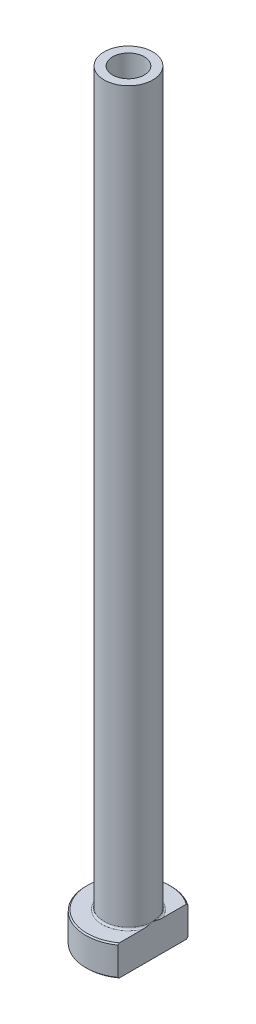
ISO-10303-21;
HEADER;
FILE_DESCRIPTION(('STEP AP214'),'2;1');
FILE_NAME('part.step','',(''),(''),'','','');
FILE_SCHEMA(('AUTOMOTIVE_DESIGN { 1 0 10303 214 1 1 1 1 }'));
ENDSEC;
DATA;
#1=APPLICATION_CONTEXT('core data for automotive mechanical design processes');
#2=APPLICATION_PROTOCOL_DEFINITION('international standard','automotive_design',2000,#1);
#3=PRODUCT_CONTEXT('',#1,'mechanical');
#4=PRODUCT('Part','Part','',(#3));
#5=PRODUCT_RELATED_PRODUCT_CATEGORY('part','',(#4));
#6=PRODUCT_DEFINITION_FORMATION('','',#4);
#7=PRODUCT_DEFINITION_CONTEXT('part definition',#1,'design');
#8=PRODUCT_DEFINITION('design','',#6,#7);
#9=PRODUCT_DEFINITION_SHAPE('','',#8);
#10=(LENGTH_UNIT() NAMED_UNIT(*) SI_UNIT(.MILLI.,.METRE.));
#11=(NAMED_UNIT(*) PLANE_ANGLE_UNIT() SI_UNIT($,.RADIAN.));
#12=(NAMED_UNIT(*) SI_UNIT($,.STERADIAN.) SOLID_ANGLE_UNIT());
#13=UNCERTAINTY_MEASURE_WITH_UNIT(LENGTH_MEASURE(1.E-05),#10,'distance_accuracy_value','');
#14=(GEOMETRIC_REPRESENTATION_CONTEXT(3) GLOBAL_UNCERTAINTY_ASSIGNED_CONTEXT((#13)) GLOBAL_UNIT_ASSIGNED_CONTEXT((#10,
#11,#12)) REPRESENTATION_CONTEXT('',''));
#15=CARTESIAN_POINT('',(0.,0.,0.));
#16=DIRECTION('',(0.,0.,1.));
#17=DIRECTION('',(1.,0.,0.));
#18=AXIS2_PLACEMENT_3D('',#15,#16,#17);
#19=CARTESIAN_POINT('',(0.,92.1876809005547,0.));
#20=DIRECTION('',(0.,1.,0.));
#21=DIRECTION('',(0.,0.,1.));
#22=AXIS2_PLACEMENT_3D('',#19,#20,#21);
#23=CYLINDRICAL_SURFACE('',#22,2.59999999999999);
#24=CARTESIAN_POINT('',(0.,125.,0.));
#25=DIRECTION('',(0.,1.,0.));
#26=DIRECTION('',(0.,0.,1.));
#27=AXIS2_PLACEMENT_3D('',#24,#25,#26);
#28=CIRCLE('',#27,2.6);
#29=CARTESIAN_POINT('',(0.,125.,2.6));
#30=VERTEX_POINT('',#29);
#31=EDGE_CURVE('E167',#30,#30,#28,.T.);
#32=ORIENTED_EDGE('',*,*,#31,.T.);
#33=EDGE_LOOP('',(#32));
#34=FACE_BOUND('',#33,.T.);
#35=CARTESIAN_POINT('',(0.,80.,0.));
#36=DIRECTION('',(0.,1.,0.));
#37=DIRECTION('',(0.,0.,1.));
#38=AXIS2_PLACEMENT_3D('',#35,#36,#37);
#39=CIRCLE('',#38,2.59999999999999);
#40=CARTESIAN_POINT('',(0.,80.,2.59999999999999));
#41=VERTEX_POINT('',#40);
#42=EDGE_CURVE('E170',#41,#41,#39,.T.);
#43=ORIENTED_EDGE('',*,*,#42,.F.);
#44=EDGE_LOOP('',(#43));
#45=FACE_BOUND('',#44,.T.);
#46=ADVANCED_FACE('F32',(#34,#45),#23,.F.);
#47=CARTESIAN_POINT('',(-2.6,125.,0.));
#48=DIRECTION('',(0.,1.,0.));
#49=DIRECTION('',(0.,0.,1.));
#50=AXIS2_PLACEMENT_3D('',#47,#48,#49);
#51=PLANE('',#50);
#52=CARTESIAN_POINT('',(0.,125.,0.));
#53=DIRECTION('',(0.,1.,0.));
#54=DIRECTION('',(0.,0.,1.));
#55=AXIS2_PLACEMENT_3D('',#52,#53,#54);
#56=CIRCLE('',#55,4.);
#57=CARTESIAN_POINT('',(0.,125.,4.));
#58=VERTEX_POINT('',#57);
#59=EDGE_CURVE('E174',#58,#58,#56,.T.);
#60=ORIENTED_EDGE('',*,*,#59,.T.);
#61=EDGE_LOOP('',(#60));
#62=FACE_BOUND('',#61,.T.);
#63=ORIENTED_EDGE('',*,*,#31,.F.);
#64=EDGE_LOOP('',(#63));
#65=FACE_BOUND('',#64,.T.);
#66=ADVANCED_FACE('F157',(#62,#65),#51,.T.);
#67=CARTESIAN_POINT('',(0.,92.1876809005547,0.));
#68=DIRECTION('',(0.,1.,0.));
#69=DIRECTION('',(0.,0.,1.));
#70=AXIS2_PLACEMENT_3D('',#67,#68,#69);
#71=CYLINDRICAL_SURFACE('',#70,4.);
#72=CARTESIAN_POINT('',(0.,5.3,0.));
#73=DIRECTION('',(0.,1.,0.));
#74=DIRECTION('',(0.,0.,1.));
#75=AXIS2_PLACEMENT_3D('',#72,#73,#74);
#76=CIRCLE('',#75,4.);
#77=CARTESIAN_POINT('',(4.,5.3,0.));
#78=VERTEX_POINT('',#77);
#79=EDGE_CURVE('E180',#78,#78,#76,.T.);
#80=ORIENTED_EDGE('',*,*,#79,.T.);
#81=EDGE_LOOP('',(#80));
#82=FACE_BOUND('',#81,.T.);
#83=ORIENTED_EDGE('',*,*,#59,.F.);
#84=EDGE_LOOP('',(#83));
#85=FACE_BOUND('',#84,.T.);
#86=ADVANCED_FACE('F162',(#82,#85),#71,.T.);
#87=CARTESIAN_POINT('',(-3.99999999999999,5.,0.));
#88=DIRECTION('',(0.,1.,0.));
#89=DIRECTION('',(0.,0.,1.));
#90=AXIS2_PLACEMENT_3D('',#87,#88,#89);
#91=PLANE('',#90);
#92=DIRECTION('',(0.,0.,1.));
#93=VECTOR('',#92,1.);
#94=CARTESIAN_POINT('',(4.,5.,0.));
#95=LINE('',#94,#93);
#96=CARTESIAN_POINT('',(4.,5.,-5.499090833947));
#97=VERTEX_POINT('',#96);
#98=CARTESIAN_POINT('',(4.,5.,-1.57797338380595));
#99=VERTEX_POINT('',#98);
#100=EDGE_CURVE('E54',#97,#99,#95,.T.);
#101=ORIENTED_EDGE('',*,*,#100,.F.);
#102=CARTESIAN_POINT('',(0.,5.,0.));
#103=DIRECTION('',(0.,1.,0.));
#104=DIRECTION('',(0.,0.,1.));
#105=AXIS2_PLACEMENT_3D('',#102,#103,#104);
#106=CIRCLE('',#105,6.79999999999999);
#107=CARTESIAN_POINT('',(3.99999999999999,5.,5.499090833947));
#108=VERTEX_POINT('',#107);
#109=EDGE_CURVE('E186',#97,#108,#106,.T.);
#110=ORIENTED_EDGE('',*,*,#109,.T.);
#111=CARTESIAN_POINT('',(4.,5.,1.57797338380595));
#112=VERTEX_POINT('',#111);
#113=EDGE_CURVE('E134',#112,#108,#95,.T.);
#114=ORIENTED_EDGE('',*,*,#113,.F.);
#115=CARTESIAN_POINT('',(0.,5.,0.));
#116=DIRECTION('',(0.,1.,0.));
#117=DIRECTION('',(0.,0.,1.));
#118=AXIS2_PLACEMENT_3D('',#115,#116,#117);
#119=CIRCLE('',#118,4.3);
#120=EDGE_CURVE('E183',#112,#99,#119,.F.);
#121=ORIENTED_EDGE('',*,*,#120,.T.);
#122=EDGE_LOOP('',(#101,#110,#114,#121));
#123=FACE_BOUND('',#122,.T.);
#124=ADVANCED_FACE('F197',(#123),#91,.T.);
#125=CARTESIAN_POINT('',(0.,92.1876809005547,0.));
#126=DIRECTION('',(0.,1.,0.));
#127=DIRECTION('',(0.,0.,1.));
#128=AXIS2_PLACEMENT_3D('',#125,#126,#127);
#129=CYLINDRICAL_SURFACE('',#128,6.99999999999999);
#130=DIRECTION('',(0.,-1.,0.));
#131=VECTOR('',#130,1.);
#132=CARTESIAN_POINT('',(3.99999999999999,125.,5.74456264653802));
#133=LINE('',#132,#131);
#134=CARTESIAN_POINT('',(3.99999999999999,4.8,5.74456264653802));
#135=VERTEX_POINT('',#134);
#136=CARTESIAN_POINT('',(3.99999999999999,0.200000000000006,5.74456264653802));
#137=VERTEX_POINT('',#136);
#138=EDGE_CURVE('E82',#135,#137,#133,.T.);
#139=ORIENTED_EDGE('',*,*,#138,.F.);
#140=CARTESIAN_POINT('',(0.,4.8,0.));
#141=DIRECTION('',(0.,1.,0.));
#142=DIRECTION('',(0.,0.,1.));
#143=AXIS2_PLACEMENT_3D('',#140,#141,#142);
#144=CIRCLE('',#143,6.99999999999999);
#145=CARTESIAN_POINT('',(4.,4.8,-5.74456264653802));
#146=VERTEX_POINT('',#145);
#147=EDGE_CURVE('E95',#135,#146,#144,.F.);
#148=ORIENTED_EDGE('',*,*,#147,.T.);
#149=DIRECTION('',(0.,-1.,0.));
#150=VECTOR('',#149,1.);
#151=CARTESIAN_POINT('',(4.,125.,-5.74456264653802));
#152=LINE('',#151,#150);
#153=CARTESIAN_POINT('',(4.,0.200000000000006,-5.74456264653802));
#154=VERTEX_POINT('',#153);
#155=EDGE_CURVE('E192',#146,#154,#152,.T.);
#156=ORIENTED_EDGE('',*,*,#155,.T.);
#157=CARTESIAN_POINT('',(0.,0.200000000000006,0.));
#158=DIRECTION('',(0.,-1.,0.));
#159=DIRECTION('',(0.,0.,-1.));
#160=AXIS2_PLACEMENT_3D('',#157,#158,#159);
#161=CIRCLE('',#160,6.99999999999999);
#162=EDGE_CURVE('E98',#154,#137,#161,.F.);
#163=ORIENTED_EDGE('',*,*,#162,.T.);
#164=EDGE_LOOP('',(#139,#148,#156,#163));
#165=FACE_BOUND('',#164,.T.);
#166=ADVANCED_FACE('F190',(#165),#129,.T.);
#167=CARTESIAN_POINT('',(-6.99999999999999,0.,0.));
#168=DIRECTION('',(0.,-1.,0.));
#169=DIRECTION('',(0.,0.,-1.));
#170=AXIS2_PLACEMENT_3D('',#167,#168,#169);
#171=PLANE('',#170);
#172=CARTESIAN_POINT('',(0.,0.,0.));
#173=DIRECTION('',(0.,-1.,0.));
#174=DIRECTION('',(0.,0.,-1.));
#175=AXIS2_PLACEMENT_3D('',#172,#173,#174);
#176=CIRCLE('',#175,3.34999999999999);
#177=CARTESIAN_POINT('',(0.,0.,-3.34999999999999));
#178=VERTEX_POINT('',#177);
#179=EDGE_CURVE('E40',#178,#178,#176,.F.);
#180=ORIENTED_EDGE('',*,*,#179,.T.);
#181=EDGE_LOOP('',(#180));
#182=FACE_BOUND('',#181,.T.);
#183=DIRECTION('',(0.,0.,-1.));
#184=VECTOR('',#183,1.);
#185=CARTESIAN_POINT('',(3.99999999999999,0.,5.74456264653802));
#186=LINE('',#185,#184);
#187=CARTESIAN_POINT('',(3.99999999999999,0.,5.49909083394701));
#188=VERTEX_POINT('',#187);
#189=CARTESIAN_POINT('',(4.,0.,-5.49909083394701));
#190=VERTEX_POINT('',#189);
#191=EDGE_CURVE('E47',#188,#190,#186,.T.);
#192=ORIENTED_EDGE('',*,*,#191,.F.);
#193=CARTESIAN_POINT('',(0.,0.,0.));
#194=DIRECTION('',(0.,-1.,0.));
#195=DIRECTION('',(0.,0.,-1.));
#196=AXIS2_PLACEMENT_3D('',#193,#194,#195);
#197=CIRCLE('',#196,6.8);
#198=EDGE_CURVE('E92',#188,#190,#197,.T.);
#199=ORIENTED_EDGE('',*,*,#198,.T.);
#200=EDGE_LOOP('',(#192,#199));
#201=FACE_BOUND('',#200,.T.);
#202=ADVANCED_FACE('F91',(#182,#201),#171,.T.);
#203=CARTESIAN_POINT('',(0.,92.1876809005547,0.));
#204=DIRECTION('',(0.,1.,0.));
#205=DIRECTION('',(0.,0.,1.));
#206=AXIS2_PLACEMENT_3D('',#203,#204,#205);
#207=CYLINDRICAL_SURFACE('',#206,2.84999999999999);
#208=CARTESIAN_POINT('',(0.,0.5,0.));
#209=DIRECTION('',(0.,-1.,0.));
#210=DIRECTION('',(0.,0.,-1.));
#211=AXIS2_PLACEMENT_3D('',#208,#209,#210);
#212=CIRCLE('',#211,2.84999999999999);
#213=CARTESIAN_POINT('',(0.,0.5,-2.84999999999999));
#214=VERTEX_POINT('',#213);
#215=EDGE_CURVE('E11',#214,#214,#212,.T.);
#216=ORIENTED_EDGE('',*,*,#215,.T.);
#217=EDGE_LOOP('',(#216));
#218=FACE_BOUND('',#217,.T.);
#219=CARTESIAN_POINT('',(0.,68.,0.));
#220=DIRECTION('',(0.,1.,0.));
#221=DIRECTION('',(0.,0.,1.));
#222=AXIS2_PLACEMENT_3D('',#219,#220,#221);
#223=CIRCLE('',#222,2.85);
#224=CARTESIAN_POINT('',(0.,68.,2.85));
#225=VERTEX_POINT('',#224);
#226=EDGE_CURVE('E172',#225,#225,#223,.T.);
#227=ORIENTED_EDGE('',*,*,#226,.T.);
#228=EDGE_LOOP('',(#227));
#229=FACE_BOUND('',#228,.T.);
#230=ADVANCED_FACE('F215',(#218,#229),#207,.F.);
#231=CARTESIAN_POINT('',(0.,68.,0.));
#232=DIRECTION('',(0.,-1.,0.));
#233=DIRECTION('',(0.,0.,-1.));
#234=AXIS2_PLACEMENT_3D('',#231,#232,#233);
#235=CONICAL_SURFACE('',#234,2.85,0.0208303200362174);
#236=ORIENTED_EDGE('',*,*,#42,.T.);
#237=EDGE_LOOP('',(#236));
#238=FACE_BOUND('',#237,.T.);
#239=ORIENTED_EDGE('',*,*,#226,.F.);
#240=EDGE_LOOP('',(#239));
#241=FACE_BOUND('',#240,.T.);
#242=ADVANCED_FACE('F111',(#238,#241),#235,.F.);
#243=CARTESIAN_POINT('',(0.,5.3,0.));
#244=DIRECTION('',(0.,1.,0.));
#245=DIRECTION('',(0.,0.,1.));
#246=AXIS2_PLACEMENT_3D('',#243,#244,#245);
#247=TOROIDAL_SURFACE('',#246,4.3,0.3);
#248=ORIENTED_EDGE('',*,*,#120,.F.);
#249=CARTESIAN_POINT('',(4.,5.3,0.));
#250=CARTESIAN_POINT('',(4.,5.30000062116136,-1.06250841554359E-10));
#251=CARTESIAN_POINT('',(4.,5.30000124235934,2.17726032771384E-07));
#252=CARTESIAN_POINT('',(4.,5.30000240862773,8.3614092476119E-07));
#253=CARTESIAN_POINT('',(4.,5.3000029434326,1.25011671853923E-06));
#254=CARTESIAN_POINT('',(4.,5.30000404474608,2.23959324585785E-06));
#255=CARTESIAN_POINT('',(4.,5.30000459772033,2.8308444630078E-06));
#256=CARTESIAN_POINT('',(4.,5.30000559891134,4.0651658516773E-06));
#257=CARTESIAN_POINT('',(4.,5.3000060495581,4.70640066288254E-06));
#258=CARTESIAN_POINT('',(4.,5.3000076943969,7.15677177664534E-06));
#259=CARTESIAN_POINT('',(4.,5.30000879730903,9.02995935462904E-06));
#260=CARTESIAN_POINT('',(4.,5.30001063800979,1.27664882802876E-05));
#261=CARTESIAN_POINT('',(4.,5.30001139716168,1.46197802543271E-05));
#262=CARTESIAN_POINT('',(4.,5.30001453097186,2.23679215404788E-05));
#263=CARTESIAN_POINT('',(4.,5.30001683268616,2.82968740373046E-05));
#264=CARTESIAN_POINT('',(4.,5.3000202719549,3.95668719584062E-05));
#265=CARTESIAN_POINT('',(4.,5.30002152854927,4.48715452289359E-05));
#266=CARTESIAN_POINT('',(4.,5.30003060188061,8.40118184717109E-05));
#267=CARTESIAN_POINT('',(4.,5.30003739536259,0.00011802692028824));
#268=CARTESIAN_POINT('',(4.,5.30006713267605,0.000252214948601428));
#269=CARTESIAN_POINT('',(4.,5.30009559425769,0.000351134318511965));
#270=CARTESIAN_POINT('',(4.,5.30020622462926,0.000742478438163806));
#271=CARTESIAN_POINT('',(4.,5.30028475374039,0.00103561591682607));
#272=CARTESIAN_POINT('',(4.,5.30059889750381,0.00219920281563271));
#273=CARTESIAN_POINT('',(4.,5.30083905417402,0.00306873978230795));
#274=CARTESIAN_POINT('',(4.,5.30183682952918,0.00669141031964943));
#275=CARTESIAN_POINT('',(4.,5.30258877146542,0.00944568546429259));
#276=CARTESIAN_POINT('',(4.,5.31066890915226,0.0390293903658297));
#277=CARTESIAN_POINT('',(4.,5.31802631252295,0.0658531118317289));
#278=CARTESIAN_POINT('',(4.,5.33239676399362,0.118441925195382));
#279=CARTESIAN_POINT('',(4.,5.33941183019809,0.144206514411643));
#280=CARTESIAN_POINT('',(4.,5.35427366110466,0.199017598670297));
#281=CARTESIAN_POINT('',(4.,5.36211313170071,0.228066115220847));
#282=CARTESIAN_POINT('',(4.,5.37776349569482,0.286511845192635));
#283=CARTESIAN_POINT('',(4.,5.38557313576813,0.315909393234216));
#284=CARTESIAN_POINT('',(4.,5.40425662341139,0.386994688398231));
#285=CARTESIAN_POINT('',(4.,5.4150523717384,0.428703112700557));
#286=CARTESIAN_POINT('',(4.,5.43592310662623,0.511098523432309));
#287=CARTESIAN_POINT('',(4.,5.44600969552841,0.551782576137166));
#288=CARTESIAN_POINT('',(4.,5.47850986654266,0.686599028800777));
#289=CARTESIAN_POINT('',(4.,5.49978370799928,0.781011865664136));
#290=CARTESIAN_POINT('',(4.,5.53807543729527,0.971847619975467));
#291=CARTESIAN_POINT('',(4.,5.55504273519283,1.06828120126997));
#292=CARTESIAN_POINT('',(4.,5.57582405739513,1.21752725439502));
#293=CARTESIAN_POINT('',(4.,5.58209796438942,1.26999379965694));
#294=CARTESIAN_POINT('',(4.,5.59210686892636,1.37516324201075));
#295=CARTESIAN_POINT('',(4.,5.59584265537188,1.42786606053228));
#296=CARTESIAN_POINT('',(4.,5.60010438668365,1.53310673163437));
#297=CARTESIAN_POINT('',(4.,5.6006487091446,1.58564378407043));
#298=CARTESIAN_POINT('',(4.,5.59767158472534,1.69058605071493));
#299=CARTESIAN_POINT('',(4.,5.59415502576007,1.74299134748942));
#300=CARTESIAN_POINT('',(4.,5.58503062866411,1.81903290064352));
#301=CARTESIAN_POINT('',(4.,5.5815761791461,1.8429293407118));
#302=CARTESIAN_POINT('',(4.,5.57329952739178,1.8905106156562));
#303=CARTESIAN_POINT('',(4.,5.56847619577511,1.91419525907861));
#304=CARTESIAN_POINT('',(4.,5.55726644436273,1.9609288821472));
#305=CARTESIAN_POINT('',(4.,5.55089740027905,1.98398195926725));
#306=CARTESIAN_POINT('',(4.,5.53623434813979,2.02945550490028));
#307=CARTESIAN_POINT('',(4.,5.52794253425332,2.05187666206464));
#308=CARTESIAN_POINT('',(4.,5.50887098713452,2.0959063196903));
#309=CARTESIAN_POINT('',(4.,5.49806837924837,2.11750508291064));
#310=CARTESIAN_POINT('',(4.,5.47333401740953,2.15885583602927));
#311=CARTESIAN_POINT('',(4.,5.45941272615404,2.17861369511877));
#312=CARTESIAN_POINT('',(4.,5.43588221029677,2.20522942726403));
#313=CARTESIAN_POINT('',(4.,5.4278113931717,2.21344043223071));
#314=CARTESIAN_POINT('',(4.,5.41065114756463,2.22875149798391));
#315=CARTESIAN_POINT('',(4.,5.40156129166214,2.2358510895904));
#316=CARTESIAN_POINT('',(4.,5.38220524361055,2.24859694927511));
#317=CARTESIAN_POINT('',(4.,5.37192420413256,2.2542211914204));
#318=CARTESIAN_POINT('',(4.,5.35045072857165,2.2633106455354));
#319=CARTESIAN_POINT('',(4.,5.33926122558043,2.26678251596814));
#320=CARTESIAN_POINT('',(4.,5.31952044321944,2.27051268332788));
#321=CARTESIAN_POINT('',(4.,5.31108453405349,2.27139016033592));
#322=CARTESIAN_POINT('',(4.,5.29418624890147,2.2716896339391));
#323=CARTESIAN_POINT('',(4.,5.28572387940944,2.27111196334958));
#324=CARTESIAN_POINT('',(4.,5.26904138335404,2.26855580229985));
#325=CARTESIAN_POINT('',(4.,5.26082066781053,2.26658107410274));
#326=CARTESIAN_POINT('',(4.,5.24478214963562,2.26139496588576));
#327=CARTESIAN_POINT('',(4.,5.23696461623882,2.25818277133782));
#328=CARTESIAN_POINT('',(4.,5.21851235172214,2.24908332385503));
#329=CARTESIAN_POINT('',(4.,5.20815219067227,2.24264095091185));
#330=CARTESIAN_POINT('',(4.,5.18857975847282,2.22819957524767));
#331=CARTESIAN_POINT('',(4.,5.17937061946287,2.2201964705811));
#332=CARTESIAN_POINT('',(4.,5.15665383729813,2.19777756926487));
#333=CARTESIAN_POINT('',(4.,5.14403484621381,2.18246908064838));
#334=CARTESIAN_POINT('',(4.,5.12118369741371,2.15020843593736));
#335=CARTESIAN_POINT('',(4.,5.11095480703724,2.13325407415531));
#336=CARTESIAN_POINT('',(4.,5.09273574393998,2.09892324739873));
#337=CARTESIAN_POINT('',(4.,5.08468212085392,2.0815798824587));
#338=CARTESIAN_POINT('',(4.,5.07005901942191,2.04627072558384));
#339=CARTESIAN_POINT('',(4.,5.06349101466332,2.02830433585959));
#340=CARTESIAN_POINT('',(4.,5.04555485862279,1.97350761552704));
#341=CARTESIAN_POINT('',(4.,5.03608974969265,1.93605770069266));
#342=CARTESIAN_POINT('',(4.,5.01780569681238,1.84529235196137));
#343=CARTESIAN_POINT('',(4.,5.01077018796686,1.79164082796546));
#344=CARTESIAN_POINT('',(4.,5.00182846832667,1.68379947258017));
#345=CARTESIAN_POINT('',(4.,4.9999388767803,1.62960846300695));
#346=CARTESIAN_POINT('',(4.,5.00006129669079,1.52361204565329));
#347=CARTESIAN_POINT('',(4.,5.0019069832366,1.4718055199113));
#348=CARTESIAN_POINT('',(4.,5.00841243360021,1.36835357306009));
#349=CARTESIAN_POINT('',(4.,5.01307376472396,1.31670825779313));
#350=CARTESIAN_POINT('',(4.,5.02905484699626,1.17431887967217));
#351=CARTESIAN_POINT('',(4.,5.04274090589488,1.08384207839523));
#352=CARTESIAN_POINT('',(4.,5.06701714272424,0.947757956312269));
#353=CARTESIAN_POINT('',(4.,5.07585573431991,0.901814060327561));
#354=CARTESIAN_POINT('',(4.,5.09458665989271,0.810008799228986));
#355=CARTESIAN_POINT('',(4.,5.10448180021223,0.764148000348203));
#356=CARTESIAN_POINT('',(4.,5.12892434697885,0.655631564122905));
#357=CARTESIAN_POINT('',(4.,5.14383556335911,0.593058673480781));
#358=CARTESIAN_POINT('',(4.,5.17458762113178,0.468885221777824));
#359=CARTESIAN_POINT('',(4.,5.19041623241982,0.40728160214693));
#360=CARTESIAN_POINT('',(4.,5.22090834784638,0.291232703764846));
#361=CARTESIAN_POINT('',(3.99999999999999,5.23550024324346,0.236768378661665));
#362=CARTESIAN_POINT('',(4.,5.26562550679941,0.125604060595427));
#363=CARTESIAN_POINT('',(4.,5.28117250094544,0.0689076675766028));
#364=CARTESIAN_POINT('',(4.,5.29741226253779,0.00944154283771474));
#365=CARTESIAN_POINT('',(4.,5.29816540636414,0.00668315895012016));
#366=CARTESIAN_POINT('',(4.,5.29916346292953,0.00305954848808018));
#367=CARTESIAN_POINT('',(4.,5.29940273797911,0.00219318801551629));
#368=CARTESIAN_POINT('',(4.,5.29971580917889,0.00103357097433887));
#369=CARTESIAN_POINT('',(4.,5.29979412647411,0.000741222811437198));
#370=CARTESIAN_POINT('',(4.,5.29990450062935,0.000350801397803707));
#371=CARTESIAN_POINT('',(4.,5.29993292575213,0.000252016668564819));
#372=CARTESIAN_POINT('',(4.,5.29996263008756,0.000117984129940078));
#373=CARTESIAN_POINT('',(4.,5.29996941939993,8.39881868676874E-05));
#374=CARTESIAN_POINT('',(4.,5.29997848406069,4.48673995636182E-05));
#375=CARTESIAN_POINT('',(4.,5.29997973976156,3.95638168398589E-05));
#376=CARTESIAN_POINT('',(4.,5.29998317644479,2.82960319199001E-05));
#377=CARTESIAN_POINT('',(4.,5.29998547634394,2.23681441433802E-05));
#378=CARTESIAN_POINT('',(4.,5.29998860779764,1.46210991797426E-05));
#379=CARTESIAN_POINT('',(4.,5.29998936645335,1.27678889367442E-05));
#380=CARTESIAN_POINT('',(4.,5.29999120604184,9.03143958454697E-06));
#381=CARTESIAN_POINT('',(3.99999999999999,5.29999230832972,7.15824011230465E-06));
#382=CARTESIAN_POINT('',(4.,5.29999395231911,4.70775473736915E-06));
#383=CARTESIAN_POINT('',(4.,5.29999440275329,4.0664633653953E-06));
#384=CARTESIAN_POINT('',(4.,5.29999540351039,2.83199048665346E-06));
#385=CARTESIAN_POINT('',(4.,5.29999595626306,2.24064311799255E-06));
#386=CARTESIAN_POINT('',(4.,5.29999705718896,1.25093951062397E-06));
#387=CARTESIAN_POINT('',(4.,5.29999759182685,8.36840897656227E-07));
#388=CARTESIAN_POINT('',(4.,5.29999875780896,2.18117671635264E-07));
#389=CARTESIAN_POINT('',(4.,5.29999937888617,1.06243919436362E-10));
#390=CARTESIAN_POINT('',(4.,5.3,0.));
#391=B_SPLINE_CURVE_WITH_KNOTS('',3,(#249,#250,#251,#252,#253,#254,#255,#256,#257,#258,#259,
#260,#261,#262,#263,#264,#265,#266,#267,#268,#269,#270,#271,#272,#273,#274,#275,#276,#277,#278,
#279,#280,#281,#282,#283,#284,#285,#286,#287,#288,#289,#290,#291,#292,#293,#294,#295,#296,#297,
#298,#299,#300,#301,#302,#303,#304,#305,#306,#307,#308,#309,#310,#311,#312,#313,#314,#315,#316,
#317,#318,#319,#320,#321,#322,#323,#324,#325,#326,#327,#328,#329,#330,#331,#332,#333,#334,#335,
#336,#337,#338,#339,#340,#341,#342,#343,#344,#345,#346,#347,#348,#349,#350,#351,#352,#353,#354,
#355,#356,#357,#358,#359,#360,#361,#362,#363,#364,#365,#366,#367,#368,#369,#370,#371,#372,#373,
#374,#375,#376,#377,#378,#379,#380,#381,#382,#383,#384,#385,#386,#387,#388,#389,#390),
.UNSPECIFIED.,.T.,.F.,(4,2,2,2,2,2,2,2,2,2,2,2,2,2,2,2,2,2,2,2,2,2,2,2,2,2,2,2,2,2,2,2,2,2,2,2,
2,2,2,2,2,2,2,2,2,2,2,2,2,2,2,2,2,2,2,2,2,2,2,2,2,2,2,2,2,2,2,2,2,2,4),(0.,1.87484510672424E-06,
3.90180199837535E-06,6.31684073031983E-06,8.66652276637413E-06,1.51627590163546E-05,
2.11657978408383E-05,4.02090820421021E-05,5.65429529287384E-05,0.000160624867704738,
0.000469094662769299,0.00137985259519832,0.00408571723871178,0.0126514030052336,
0.0960918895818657,0.17620014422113,0.266463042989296,0.357714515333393,0.486961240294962,
0.612707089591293,0.902988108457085,1.19653589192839,1.35501075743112,1.5134363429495,
1.67094875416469,1.82827177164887,1.90067591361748,1.97313996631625,2.04482437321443,
2.116427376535,2.18871023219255,2.26075412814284,2.29521947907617,2.32969934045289,
2.36466792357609,2.39952778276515,2.42485422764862,2.4501748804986,2.4754276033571,
2.50069697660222,2.53708899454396,2.57357798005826,2.63276032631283,2.69202310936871,
2.74930315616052,2.80663977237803,2.92223125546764,3.0842075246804,3.24670629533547,
3.40212850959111,3.55763731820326,3.83192962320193,3.97228382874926,4.11302057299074,
4.30598130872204,4.4967888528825,4.66594443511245,4.84230602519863,4.85088453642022,
4.85358051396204,4.85448881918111,4.85479687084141,4.85490089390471,4.85491722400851,
4.85493626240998,4.85494226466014,4.85494875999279,4.85495110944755,4.85495352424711,
4.85495555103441,4.85495742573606),.UNSPECIFIED.);
#392=EDGE_CURVE('E126',#112,#78,#391,.T.);
#393=ORIENTED_EDGE('',*,*,#392,.T.);
#394=ORIENTED_EDGE('',*,*,#79,.F.);
#395=CARTESIAN_POINT('',(4.,5.3,0.));
#396=CARTESIAN_POINT('',(4.,5.29999937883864,1.06251803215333E-10));
#397=CARTESIAN_POINT('',(4.,5.29999875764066,-2.17726031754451E-07));
#398=CARTESIAN_POINT('',(4.,5.29999759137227,-8.36140923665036E-07));
#399=CARTESIAN_POINT('',(4.,5.2999970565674,-1.25011671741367E-06));
#400=CARTESIAN_POINT('',(4.,5.29999595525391,-2.23959324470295E-06));
#401=CARTESIAN_POINT('',(4.,5.29999540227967,-2.8308444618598E-06));
#402=CARTESIAN_POINT('',(4.,5.29999440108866,-4.06516585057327E-06));
#403=CARTESIAN_POINT('',(4.,5.2999939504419,-4.70640066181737E-06));
#404=CARTESIAN_POINT('',(4.,5.2999923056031,-7.15677177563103E-06));
#405=CARTESIAN_POINT('',(4.,5.29999120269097,-9.02995935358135E-06));
#406=CARTESIAN_POINT('',(4.,5.29998936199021,-1.27664882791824E-05));
#407=CARTESIAN_POINT('',(4.,5.29998860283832,-1.46197802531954E-05));
#408=CARTESIAN_POINT('',(4.,5.29998546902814,-2.23679215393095E-05));
#409=CARTESIAN_POINT('',(4.,5.29998316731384,-2.82968740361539E-05));
#410=CARTESIAN_POINT('',(4.,5.2999797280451,-3.95668719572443E-05));
#411=CARTESIAN_POINT('',(4.,5.29997847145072,-4.48715452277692E-05));
#412=CARTESIAN_POINT('',(4.,5.29996939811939,-8.40118184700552E-05));
#413=CARTESIAN_POINT('',(4.,5.2999626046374,-0.000118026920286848));
#414=CARTESIAN_POINT('',(4.,5.29993286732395,-0.000252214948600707));
#415=CARTESIAN_POINT('',(4.,5.29990440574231,-0.000351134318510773));
#416=CARTESIAN_POINT('',(4.,5.29979377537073,-0.000742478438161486));
#417=CARTESIAN_POINT('',(4.,5.29971524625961,-0.00103561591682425));
#418=CARTESIAN_POINT('',(4.,5.29940110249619,-0.00219920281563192));
#419=CARTESIAN_POINT('',(4.,5.29916094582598,-0.00306873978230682));
#420=CARTESIAN_POINT('',(4.,5.29816317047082,-0.00669141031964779));
#421=CARTESIAN_POINT('',(4.,5.29741122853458,-0.00944568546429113));
#422=CARTESIAN_POINT('',(4.,5.28933109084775,-0.0390293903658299));
#423=CARTESIAN_POINT('',(4.,5.28197368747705,-0.0658531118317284));
#424=CARTESIAN_POINT('',(4.,5.26760323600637,-0.118441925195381));
#425=CARTESIAN_POINT('',(4.,5.2605881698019,-0.144206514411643));
#426=CARTESIAN_POINT('',(4.,5.24572633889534,-0.199017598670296));
#427=CARTESIAN_POINT('',(4.,5.23788686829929,-0.228066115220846));
#428=CARTESIAN_POINT('',(4.,5.22223650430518,-0.286511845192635));
#429=CARTESIAN_POINT('',(4.,5.21442686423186,-0.315909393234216));
#430=CARTESIAN_POINT('',(4.,5.1957433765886,-0.38699468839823));
#431=CARTESIAN_POINT('',(4.,5.1849476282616,-0.428703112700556));
#432=CARTESIAN_POINT('',(4.,5.16407689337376,-0.511098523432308));
#433=CARTESIAN_POINT('',(4.,5.15399030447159,-0.551782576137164));
#434=CARTESIAN_POINT('',(4.,5.12149013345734,-0.686599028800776));
#435=CARTESIAN_POINT('',(4.,5.10021629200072,-0.781011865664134));
#436=CARTESIAN_POINT('',(4.,5.06192456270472,-0.971847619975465));
#437=CARTESIAN_POINT('',(4.,5.04495726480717,-1.06828120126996));
#438=CARTESIAN_POINT('',(4.,5.02417594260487,-1.21752725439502));
#439=CARTESIAN_POINT('',(4.,5.01790203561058,-1.26999379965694));
#440=CARTESIAN_POINT('',(4.,5.00789313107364,-1.37516324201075));
#441=CARTESIAN_POINT('',(4.,5.00415734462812,-1.42786606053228));
#442=CARTESIAN_POINT('',(4.,4.99989561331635,-1.53310673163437));
#443=CARTESIAN_POINT('',(4.,4.9993512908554,-1.58564378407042));
#444=CARTESIAN_POINT('',(4.,5.00232841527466,-1.69058605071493));
#445=CARTESIAN_POINT('',(4.,5.00584497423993,-1.74299134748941));
#446=CARTESIAN_POINT('',(4.,5.01496937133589,-1.81903290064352));
#447=CARTESIAN_POINT('',(4.,5.0184238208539,-1.84292934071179));
#448=CARTESIAN_POINT('',(4.,5.02670047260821,-1.89051061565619));
#449=CARTESIAN_POINT('',(4.,5.03152380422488,-1.91419525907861));
#450=CARTESIAN_POINT('',(4.,5.04273355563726,-1.9609288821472));
#451=CARTESIAN_POINT('',(4.,5.04910259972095,-1.98398195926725));
#452=CARTESIAN_POINT('',(4.,5.06376565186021,-2.02945550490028));
#453=CARTESIAN_POINT('',(4.,5.07205746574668,-2.05187666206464));
#454=CARTESIAN_POINT('',(4.,5.09112901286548,-2.0959063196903));
#455=CARTESIAN_POINT('',(4.,5.10193162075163,-2.11750508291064));
#456=CARTESIAN_POINT('',(4.,5.12666598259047,-2.15885583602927));
#457=CARTESIAN_POINT('',(4.,5.14058727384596,-2.17861369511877));
#458=CARTESIAN_POINT('',(4.,5.16411778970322,-2.20522942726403));
#459=CARTESIAN_POINT('',(4.,5.17218860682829,-2.21344043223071));
#460=CARTESIAN_POINT('',(4.,5.18934885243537,-2.22875149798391));
#461=CARTESIAN_POINT('',(4.,5.19843870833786,-2.2358510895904));
#462=CARTESIAN_POINT('',(4.,5.21779475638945,-2.24859694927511));
#463=CARTESIAN_POINT('',(4.,5.22807579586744,-2.2542211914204));
#464=CARTESIAN_POINT('',(4.,5.24954927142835,-2.2633106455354));
#465=CARTESIAN_POINT('',(4.,5.26073877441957,-2.26678251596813));
#466=CARTESIAN_POINT('',(4.,5.28047955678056,-2.27051268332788));
#467=CARTESIAN_POINT('',(4.,5.28891546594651,-2.27139016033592));
#468=CARTESIAN_POINT('',(4.,5.30581375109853,-2.2716896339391));
#469=CARTESIAN_POINT('',(4.,5.31427612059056,-2.27111196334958));
#470=CARTESIAN_POINT('',(4.,5.33095861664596,-2.26855580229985));
#471=CARTESIAN_POINT('',(4.,5.33917933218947,-2.26658107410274));
#472=CARTESIAN_POINT('',(4.,5.35521785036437,-2.26139496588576));
#473=CARTESIAN_POINT('',(4.,5.36303538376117,-2.25818277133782));
#474=CARTESIAN_POINT('',(4.,5.38148764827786,-2.24908332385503));
#475=CARTESIAN_POINT('',(4.,5.39184780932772,-2.24264095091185));
#476=CARTESIAN_POINT('',(4.,5.41142024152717,-2.22819957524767));
#477=CARTESIAN_POINT('',(4.,5.42062938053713,-2.2201964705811));
#478=CARTESIAN_POINT('',(4.,5.44334616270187,-2.19777756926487));
#479=CARTESIAN_POINT('',(4.,5.45596515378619,-2.18246908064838));
#480=CARTESIAN_POINT('',(4.,5.47881630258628,-2.15020843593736));
#481=CARTESIAN_POINT('',(4.,5.48904519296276,-2.13325407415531));
#482=CARTESIAN_POINT('',(4.,5.50726425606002,-2.09892324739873));
#483=CARTESIAN_POINT('',(4.,5.51531787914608,-2.0815798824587));
#484=CARTESIAN_POINT('',(4.,5.52994098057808,-2.04627072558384));
#485=CARTESIAN_POINT('',(4.,5.53650898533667,-2.02830433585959));
#486=CARTESIAN_POINT('',(4.,5.55444514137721,-1.97350761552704));
#487=CARTESIAN_POINT('',(4.,5.56391025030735,-1.93605770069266));
#488=CARTESIAN_POINT('',(4.,5.58219430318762,-1.84529235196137));
#489=CARTESIAN_POINT('',(4.,5.58922981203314,-1.79164082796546));
#490=CARTESIAN_POINT('',(4.,5.59817153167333,-1.68379947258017));
#491=CARTESIAN_POINT('',(4.,5.6000611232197,-1.62960846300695));
#492=CARTESIAN_POINT('',(4.,5.59993870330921,-1.52361204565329));
#493=CARTESIAN_POINT('',(4.,5.5980930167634,-1.4718055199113));
#494=CARTESIAN_POINT('',(4.,5.59158756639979,-1.36835357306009));
#495=CARTESIAN_POINT('',(4.,5.58692623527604,-1.31670825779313));
#496=CARTESIAN_POINT('',(4.,5.57094515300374,-1.17431887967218));
#497=CARTESIAN_POINT('',(4.,5.55725909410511,-1.08384207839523));
#498=CARTESIAN_POINT('',(4.,5.53298285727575,-0.947757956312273));
#499=CARTESIAN_POINT('',(4.,5.52414426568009,-0.901814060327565));
#500=CARTESIAN_POINT('',(4.,5.50541334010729,-0.810008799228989));
#501=CARTESIAN_POINT('',(4.,5.49551819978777,-0.764148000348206));
#502=CARTESIAN_POINT('',(4.,5.47107565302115,-0.655631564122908));
#503=CARTESIAN_POINT('',(4.,5.45616443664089,-0.593058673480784));
#504=CARTESIAN_POINT('',(3.99999999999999,5.42541237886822,-0.468885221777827));
#505=CARTESIAN_POINT('',(3.99999999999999,5.40958376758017,-0.407281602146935));
#506=CARTESIAN_POINT('',(4.,5.37909165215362,-0.291232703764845));
#507=CARTESIAN_POINT('',(4.,5.36449975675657,-0.236768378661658));
#508=CARTESIAN_POINT('',(3.99999999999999,5.33437449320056,-0.125604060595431));
#509=CARTESIAN_POINT('',(3.99999999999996,5.31882749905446,-0.0689076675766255));
#510=CARTESIAN_POINT('',(4.,5.30258773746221,-0.00944154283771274));
#511=CARTESIAN_POINT('',(4.,5.30183459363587,-0.0066831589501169));
#512=CARTESIAN_POINT('',(3.99999999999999,5.30083653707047,-0.00305954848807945));
#513=CARTESIAN_POINT('',(3.99999999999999,5.30059726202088,-0.00219318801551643));
#514=CARTESIAN_POINT('',(4.,5.30028419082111,-0.00103357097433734));
#515=CARTESIAN_POINT('',(4.,5.30020587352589,-0.000741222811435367));
#516=CARTESIAN_POINT('',(3.99999999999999,5.30009549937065,-0.000350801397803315));
#517=CARTESIAN_POINT('',(3.99999999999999,5.30006707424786,-0.00025201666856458));
#518=CARTESIAN_POINT('',(4.,5.30003736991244,-0.000117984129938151));
#519=CARTESIAN_POINT('',(4.,5.30003058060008,-8.39881868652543E-05));
#520=CARTESIAN_POINT('',(4.,5.30002151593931,-4.48673995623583E-05));
#521=CARTESIAN_POINT('',(3.99999999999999,5.30002026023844,-3.95638168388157E-05));
#522=CARTESIAN_POINT('',(3.99999999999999,5.30001682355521,-2.82960319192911E-05));
#523=CARTESIAN_POINT('',(3.99999999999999,5.30001452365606,-2.23681441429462E-05));
#524=CARTESIAN_POINT('',(4.,5.30001139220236,-1.46210991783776E-05));
#525=CARTESIAN_POINT('',(4.,5.30001063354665,-1.2767888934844E-05));
#526=CARTESIAN_POINT('',(4.,5.30000879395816,-9.03143958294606E-06));
#527=CARTESIAN_POINT('',(3.99999999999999,5.30000769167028,-7.15824011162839E-06));
#528=CARTESIAN_POINT('',(4.,5.30000604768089,-4.70775473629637E-06));
#529=CARTESIAN_POINT('',(4.,5.30000559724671,-4.06646336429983E-06));
#530=CARTESIAN_POINT('',(4.,5.30000459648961,-2.83199048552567E-06));
#531=CARTESIAN_POINT('',(4.,5.30000404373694,-2.24064311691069E-06));
#532=CARTESIAN_POINT('',(4.,5.30000294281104,-1.25093950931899E-06));
#533=CARTESIAN_POINT('',(4.,5.30000240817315,-8.36840896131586E-07));
#534=CARTESIAN_POINT('',(4.,5.30000124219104,-2.18117669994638E-07));
#535=CARTESIAN_POINT('',(4.,5.30000062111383,-1.06242465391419E-10));
#536=CARTESIAN_POINT('',(4.,5.3,0.));
#537=B_SPLINE_CURVE_WITH_KNOTS('',3,(#395,#396,#397,#398,#399,#400,#401,#402,#403,#404,#405,
#406,#407,#408,#409,#410,#411,#412,#413,#414,#415,#416,#417,#418,#419,#420,#421,#422,#423,#424,
#425,#426,#427,#428,#429,#430,#431,#432,#433,#434,#435,#436,#437,#438,#439,#440,#441,#442,#443,
#444,#445,#446,#447,#448,#449,#450,#451,#452,#453,#454,#455,#456,#457,#458,#459,#460,#461,#462,
#463,#464,#465,#466,#467,#468,#469,#470,#471,#472,#473,#474,#475,#476,#477,#478,#479,#480,#481,
#482,#483,#484,#485,#486,#487,#488,#489,#490,#491,#492,#493,#494,#495,#496,#497,#498,#499,#500,
#501,#502,#503,#504,#505,#506,#507,#508,#509,#510,#511,#512,#513,#514,#515,#516,#517,#518,#519,
#520,#521,#522,#523,#524,#525,#526,#527,#528,#529,#530,#531,#532,#533,#534,#535,#536),
.UNSPECIFIED.,.T.,.F.,(4,2,2,2,2,2,2,2,2,2,2,2,2,2,2,2,2,2,2,2,2,2,2,2,2,2,2,2,2,2,2,2,2,2,2,2,
2,2,2,2,2,2,2,2,2,2,2,2,2,2,2,2,2,2,2,2,2,2,2,2,2,2,2,2,2,2,2,2,2,2,4),(0.,1.87484510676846E-06,
3.90180199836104E-06,6.31684073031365E-06,8.66652276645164E-06,1.51627590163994E-05,
2.11657978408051E-05,4.02090820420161E-05,5.65429529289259E-05,0.00016062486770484,
0.000469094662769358,0.00137985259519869,0.00408571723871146,0.0126514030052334,
0.0960918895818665,0.176200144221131,0.266463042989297,0.357714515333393,0.486961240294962,
0.612707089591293,0.902988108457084,1.19653589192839,1.35501075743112,1.5134363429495,
1.67094875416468,1.82827177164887,1.90067591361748,1.97313996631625,2.04482437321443,
2.116427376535,2.18871023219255,2.26075412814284,2.29521947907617,2.32969934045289,
2.36466792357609,2.39952778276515,2.42485422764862,2.4501748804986,2.4754276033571,
2.50069697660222,2.53708899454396,2.57357798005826,2.63276032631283,2.69202310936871,
2.74930315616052,2.80663977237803,2.92223125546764,3.0842075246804,3.24670629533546,
3.40212850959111,3.55763731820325,3.83192962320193,3.97228382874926,4.11302057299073,
4.30598130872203,4.49678885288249,4.66594443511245,4.84230602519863,4.85088453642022,
4.85358051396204,4.85448881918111,4.85479687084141,4.85490089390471,4.85491722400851,
4.85493626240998,4.85494226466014,4.85494875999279,4.85495110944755,4.8549535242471,
4.85495555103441,4.85495742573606),.UNSPECIFIED.);
#538=EDGE_CURVE('E135',#78,#99,#537,.T.);
#539=ORIENTED_EDGE('',*,*,#538,.T.);
#540=EDGE_LOOP('',(#248,#393,#394,#539));
#541=FACE_BOUND('',#540,.T.);
#542=ADVANCED_FACE('F141',(#541),#247,.F.);
#543=CARTESIAN_POINT('',(0.,5.,0.));
#544=DIRECTION('',(0.,-1.,0.));
#545=DIRECTION('',(0.,0.,-1.));
#546=AXIS2_PLACEMENT_3D('',#543,#544,#545);
#547=CONICAL_SURFACE('',#546,6.79999999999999,0.78539816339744);
#548=CARTESIAN_POINT('',(4.,-1.45712845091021,-12.6392822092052));
#549=CARTESIAN_POINT('',(4.,-1.24364466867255,-12.4153556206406));
#550=CARTESIAN_POINT('',(4.,-1.03042430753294,-12.1911774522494));
#551=CARTESIAN_POINT('',(4.,-0.604617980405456,-11.7422167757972));
#552=CARTESIAN_POINT('',(4.,-0.392032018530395,-11.5174342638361));
#553=CARTESIAN_POINT('',(4.,0.0324624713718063,-11.0670952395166));
#554=CARTESIAN_POINT('',(4.,0.244370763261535,-10.8415385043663));
#555=CARTESIAN_POINT('',(4.,0.667290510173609,-10.3895875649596));
#556=CARTESIAN_POINT('',(4.,0.878301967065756,-10.1631933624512));
#557=CARTESIAN_POINT('',(4.,1.51385375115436,-9.47810122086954));
#558=CARTESIAN_POINT('',(4.,1.93676291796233,-9.01788214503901));
#559=CARTESIAN_POINT('',(4.,2.56612335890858,-8.32309905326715));
#560=CARTESIAN_POINT('',(4.,2.77505666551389,-8.09078457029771));
#561=CARTESIAN_POINT('',(4.,3.19080254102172,-7.62426940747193));
#562=CARTESIAN_POINT('',(4.,3.39761512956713,-7.39006874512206));
#563=CARTESIAN_POINT('',(4.,3.87870763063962,-6.83891844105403));
#564=CARTESIAN_POINT('',(4.,4.15190978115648,-6.52102188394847));
#565=CARTESIAN_POINT('',(4.,4.55642425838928,-6.0396090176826));
#566=CARTESIAN_POINT('',(4.,4.69041050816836,-5.87833992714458));
#567=CARTESIAN_POINT('',(4.,4.95616531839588,-5.55398469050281));
#568=CARTESIAN_POINT('',(4.,5.08793391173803,-5.39089857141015));
#569=CARTESIAN_POINT('',(4.,5.34841712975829,-5.06288801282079));
#570=CARTESIAN_POINT('',(4.,5.47713786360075,-4.89796843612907));
#571=CARTESIAN_POINT('',(4.,5.73107494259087,-4.56545535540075));
#572=CARTESIAN_POINT('',(4.,5.85629144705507,-4.3978619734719));
#573=CARTESIAN_POINT('',(4.,6.10211465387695,-4.05948444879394));
#574=CARTESIAN_POINT('',(4.,6.22272435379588,-3.88870249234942));
#575=CARTESIAN_POINT('',(4.,6.45796076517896,-3.54308312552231));
#576=CARTESIAN_POINT('',(4.,6.57258867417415,-3.36824653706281));
#577=CARTESIAN_POINT('',(4.,6.76866603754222,-3.05381396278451));
#578=CARTESIAN_POINT('',(4.,6.85173773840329,-2.91523359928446));
#579=CARTESIAN_POINT('',(4.,7.0117453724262,-2.63451965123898));
#580=CARTESIAN_POINT('',(4.,7.08868042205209,-2.49238555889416));
#581=CARTESIAN_POINT('',(4.,7.2345943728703,-2.20416961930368));
#582=CARTESIAN_POINT('',(4.,7.30357836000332,-2.05809037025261));
#583=CARTESIAN_POINT('',(4.,7.43135520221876,-1.76151732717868));
#584=CARTESIAN_POINT('',(4.,7.49015114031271,-1.61102488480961));
#585=CARTESIAN_POINT('',(4.,7.58249315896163,-1.34142099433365));
#586=CARTESIAN_POINT('',(4.,7.61872660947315,-1.22323501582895));
#587=CARTESIAN_POINT('',(4.,7.68223354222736,-0.984492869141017));
#588=CARTESIAN_POINT('',(4.,7.70951040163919,-0.863937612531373));
#589=CARTESIAN_POINT('',(4.,7.75377914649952,-0.621342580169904));
#590=CARTESIAN_POINT('',(4.,7.77080509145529,-0.499309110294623));
#591=CARTESIAN_POINT('',(4.,7.79378778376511,-0.254194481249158));
#592=CARTESIAN_POINT('',(4.,7.79974523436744,-0.131113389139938));
#593=CARTESIAN_POINT('',(4.,7.800239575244,0.115517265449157));
#594=CARTESIAN_POINT('',(4.,7.79473514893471,0.239066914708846));
#595=CARTESIAN_POINT('',(4.,7.77255119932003,0.485148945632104));
#596=CARTESIAN_POINT('',(4.,7.75587091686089,0.607681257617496));
#597=CARTESIAN_POINT('',(4.,7.71218353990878,0.851269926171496));
#598=CARTESIAN_POINT('',(4.,7.68514362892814,0.972320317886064));
#599=CARTESIAN_POINT('',(4.,7.62201202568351,1.21200276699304));
#600=CARTESIAN_POINT('',(4.,7.58591962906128,1.33063463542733));
#601=CARTESIAN_POINT('',(4.,7.45980070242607,1.70122439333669));
#602=CARTESIAN_POINT('',(4.,7.35572950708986,1.94843335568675));
#603=CARTESIAN_POINT('',(4.,7.18186715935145,2.31048534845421));
#604=CARTESIAN_POINT('',(4.,7.12087684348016,2.42983561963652));
#605=CARTESIAN_POINT('',(4.,6.99403531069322,2.66593629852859));
#606=CARTESIAN_POINT('',(3.99999999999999,6.92818466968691,2.7826870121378));
#607=CARTESIAN_POINT('',(3.99999999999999,6.79157875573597,3.01550895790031));
#608=CARTESIAN_POINT('',(3.99999999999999,6.72076681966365,3.1315466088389));
#609=CARTESIAN_POINT('',(3.99999999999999,6.575831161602,3.36153379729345));
#610=CARTESIAN_POINT('',(3.99999999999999,6.50170736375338,3.47548328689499));
#611=CARTESIAN_POINT('',(3.99999999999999,6.35080982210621,3.70145107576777));
#612=CARTESIAN_POINT('',(3.99999999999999,6.27403866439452,3.81347110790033));
#613=CARTESIAN_POINT('',(3.99999999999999,6.11824120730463,4.03592316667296));
#614=CARTESIAN_POINT('',(3.99999999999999,6.03921496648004,4.14635523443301));
#615=CARTESIAN_POINT('',(3.99999999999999,5.81506547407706,4.4539715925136));
#616=CARTESIAN_POINT('',(3.99999999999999,5.66782256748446,4.64961120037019));
#617=CARTESIAN_POINT('',(3.99999999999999,5.36880597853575,5.03740600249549));
#618=CARTESIAN_POINT('',(3.99999999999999,5.21703183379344,5.22956083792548));
#619=CARTESIAN_POINT('',(3.99999999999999,4.90999105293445,5.61115465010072));
#620=CARTESIAN_POINT('',(3.99999999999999,4.75472331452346,5.80059273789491));
#621=CARTESIAN_POINT('',(3.99999999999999,4.44150758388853,6.1772436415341));
#622=CARTESIAN_POINT('',(3.99999999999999,4.28355951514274,6.36445639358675));
#623=CARTESIAN_POINT('',(3.99999999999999,3.96525805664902,6.73740614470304));
#624=CARTESIAN_POINT('',(3.99999999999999,3.80490084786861,6.92313987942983));
#625=CARTESIAN_POINT('',(3.99999999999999,3.48247055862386,7.29311320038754));
#626=CARTESIAN_POINT('',(3.99999999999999,3.32039746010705,7.47735277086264));
#627=CARTESIAN_POINT('',(3.99999999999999,2.83216188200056,8.02814826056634));
#628=CARTESIAN_POINT('',(3.99999999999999,2.50391696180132,8.39285790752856));
#629=CARTESIAN_POINT('',(3.99999999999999,1.87512078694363,9.08414492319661));
#630=CARTESIAN_POINT('',(3.99999999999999,1.57491666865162,9.41103929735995));
#631=CARTESIAN_POINT('',(3.99999999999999,0.972153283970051,10.0626830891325));
#632=CARTESIAN_POINT('',(3.99999999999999,0.669593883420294,10.3874323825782));
#633=CARTESIAN_POINT('',(3.99999999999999,0.0637759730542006,11.0341169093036));
#634=CARTESIAN_POINT('',(3.99999999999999,-0.239476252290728,11.3560580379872));
#635=CARTESIAN_POINT('',(3.99999999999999,-0.847356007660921,11.9985921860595));
#636=CARTESIAN_POINT('',(3.99999999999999,-1.15198342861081,12.3191853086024));
#637=CARTESIAN_POINT('',(3.99999999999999,-1.45712845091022,12.6392822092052));
#638=B_SPLINE_CURVE_WITH_KNOTS('',3,(#548,#549,#550,#551,#552,#553,#554,#555,#556,#557,#558,
#559,#560,#561,#562,#563,#564,#565,#566,#567,#568,#569,#570,#571,#572,#573,#574,#575,#576,#577,
#578,#579,#580,#581,#582,#583,#584,#585,#586,#587,#588,#589,#590,#591,#592,#593,#594,#595,#596,
#597,#598,#599,#600,#601,#602,#603,#604,#605,#606,#607,#608,#609,#610,#611,#612,#613,#614,#615,
#616,#617,#618,#619,#620,#621,#622,#623,#624,#625,#626,#627,#628,#629,#630,#631,#632,#633,#634,
#635,#636,#637),.UNSPECIFIED.,.F.,.F.,(4,2,2,2,2,2,2,2,2,2,2,2,2,2,2,2,2,2,2,2,2,2,2,2,2,2,2,2,
2,2,2,2,2,2,2,2,2,2,2,2,2,2,2,2,4),(0.,0.928152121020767,1.8563102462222,2.78476262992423,
3.71321307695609,5.58823033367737,6.52556078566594,7.4628825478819,8.72028576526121,
9.34927045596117,9.97824580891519,10.6058302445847,11.2333861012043,11.860526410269,
12.4875406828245,12.9721363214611,13.4568016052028,13.9411551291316,14.4253618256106,
14.7959147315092,15.1663277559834,15.535503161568,15.9046551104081,16.2751400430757,
16.645650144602,17.017343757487,17.3890663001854,18.1913996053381,18.5934522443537,
18.9954573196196,19.4032100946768,19.8109722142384,20.218346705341,20.6257106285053,
21.3601838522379,22.0947322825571,22.8295158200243,23.5643203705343,24.3004480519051,
25.0365834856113,26.5085499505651,27.8400191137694,29.1715646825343,30.4983881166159,
31.8251080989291),.UNSPECIFIED.);
#639=EDGE_CURVE('E133',#146,#97,#638,.T.);
#640=ORIENTED_EDGE('',*,*,#639,.F.);
#641=ORIENTED_EDGE('',*,*,#147,.F.);
#642=EDGE_CURVE('E118',#108,#135,#638,.T.);
#643=ORIENTED_EDGE('',*,*,#642,.F.);
#644=ORIENTED_EDGE('',*,*,#109,.F.);
#645=EDGE_LOOP('',(#640,#641,#643,#644));
#646=FACE_BOUND('',#645,.T.);
#647=ADVANCED_FACE('F145',(#646),#547,.T.);
#648=CARTESIAN_POINT('',(0.,0.200000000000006,0.));
#649=DIRECTION('',(0.,1.,0.));
#650=DIRECTION('',(0.,0.,1.));
#651=AXIS2_PLACEMENT_3D('',#648,#649,#650);
#652=CONICAL_SURFACE('',#651,6.99999999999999,0.785398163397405);
#653=CARTESIAN_POINT('',(3.99999999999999,6.45712845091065,12.6392822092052));
#654=CARTESIAN_POINT('',(3.99999999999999,6.24364466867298,12.4153556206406));
#655=CARTESIAN_POINT('',(3.99999999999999,6.03042430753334,12.1911774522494));
#656=CARTESIAN_POINT('',(3.99999999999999,5.60461798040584,11.7422167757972));
#657=CARTESIAN_POINT('',(3.99999999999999,5.39203201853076,11.5174342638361));
#658=CARTESIAN_POINT('',(3.99999999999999,4.96753752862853,11.0670952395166));
#659=CARTESIAN_POINT('',(3.99999999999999,4.75562923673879,10.8415385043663));
#660=CARTESIAN_POINT('',(3.99999999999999,4.33270948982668,10.3895875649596));
#661=CARTESIAN_POINT('',(3.99999999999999,4.12169803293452,10.1631933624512));
#662=CARTESIAN_POINT('',(3.99999999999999,3.48614624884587,9.47810122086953));
#663=CARTESIAN_POINT('',(3.99999999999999,3.06323708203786,9.017882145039));
#664=CARTESIAN_POINT('',(3.99999999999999,2.43387664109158,8.32309905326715));
#665=CARTESIAN_POINT('',(3.99999999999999,2.22494333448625,8.09078457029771));
#666=CARTESIAN_POINT('',(3.99999999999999,1.80919745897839,7.62426940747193));
#667=CARTESIAN_POINT('',(3.99999999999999,1.60238487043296,7.39006874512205));
#668=CARTESIAN_POINT('',(3.99999999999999,1.12129236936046,6.83891844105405));
#669=CARTESIAN_POINT('',(3.99999999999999,0.848090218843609,6.52102188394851));
#670=CARTESIAN_POINT('',(3.99999999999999,0.443575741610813,6.03960901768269));
#671=CARTESIAN_POINT('',(3.99999999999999,0.309589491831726,5.87833992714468));
#672=CARTESIAN_POINT('',(3.99999999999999,0.0438346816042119,5.55398469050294));
#673=CARTESIAN_POINT('',(3.99999999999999,-0.087933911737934,5.39089857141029));
#674=CARTESIAN_POINT('',(3.99999999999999,-0.348417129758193,5.06288801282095));
#675=CARTESIAN_POINT('',(3.99999999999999,-0.477137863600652,4.89796843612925));
#676=CARTESIAN_POINT('',(3.99999999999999,-0.731074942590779,4.56545535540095));
#677=CARTESIAN_POINT('',(3.99999999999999,-0.856291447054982,4.39786197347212));
#678=CARTESIAN_POINT('',(3.99999999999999,-1.10211465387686,4.05948444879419));
#679=CARTESIAN_POINT('',(3.99999999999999,-1.2227243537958,3.88870249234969));
#680=CARTESIAN_POINT('',(3.99999999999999,-1.45796076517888,3.54308312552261));
#681=CARTESIAN_POINT('',(3.99999999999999,-1.57258867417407,3.36824653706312));
#682=CARTESIAN_POINT('',(3.99999999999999,-1.76866603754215,3.05381396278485));
#683=CARTESIAN_POINT('',(4.,-1.85173773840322,2.91523359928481));
#684=CARTESIAN_POINT('',(4.,-2.01174537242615,2.63451965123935));
#685=CARTESIAN_POINT('',(4.,-2.08868042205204,2.49238555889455));
#686=CARTESIAN_POINT('',(4.,-2.23459437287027,2.20416961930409));
#687=CARTESIAN_POINT('',(4.,-2.3035783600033,2.05809037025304));
#688=CARTESIAN_POINT('',(4.,-2.43135520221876,1.76151732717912));
#689=CARTESIAN_POINT('',(4.,-2.49015114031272,1.61102488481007));
#690=CARTESIAN_POINT('',(4.,-2.58249315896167,1.34142099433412));
#691=CARTESIAN_POINT('',(4.,-2.6187266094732,1.22323501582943));
#692=CARTESIAN_POINT('',(4.,-2.68223354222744,0.984492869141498));
#693=CARTESIAN_POINT('',(4.,-2.70951040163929,0.863937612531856));
#694=CARTESIAN_POINT('',(4.,-2.75377914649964,0.621342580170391));
#695=CARTESIAN_POINT('',(4.,-2.77080509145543,0.499309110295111));
#696=CARTESIAN_POINT('',(4.,-2.79378778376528,0.254194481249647));
#697=CARTESIAN_POINT('',(4.,-2.79974523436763,0.131113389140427));
#698=CARTESIAN_POINT('',(4.,-2.80023957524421,-0.115517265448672));
#699=CARTESIAN_POINT('',(4.,-2.79473514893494,-0.239066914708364));
#700=CARTESIAN_POINT('',(4.,-2.77255119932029,-0.485148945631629));
#701=CARTESIAN_POINT('',(4.,-2.75587091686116,-0.607681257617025));
#702=CARTESIAN_POINT('',(4.,-2.71218353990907,-0.851269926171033));
#703=CARTESIAN_POINT('',(4.,-2.68514362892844,-0.972320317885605));
#704=CARTESIAN_POINT('',(4.,-2.62201202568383,-1.21200276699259));
#705=CARTESIAN_POINT('',(4.,-2.58591962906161,-1.33063463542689));
#706=CARTESIAN_POINT('',(4.,-2.45980070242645,-1.70122439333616));
#707=CARTESIAN_POINT('',(4.,-2.3557295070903,-1.94843335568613));
#708=CARTESIAN_POINT('',(4.,-2.18186715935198,-2.31048534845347));
#709=CARTESIAN_POINT('',(4.,-2.12087684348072,-2.42983561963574));
#710=CARTESIAN_POINT('',(4.,-1.99403531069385,-2.66593629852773));
#711=CARTESIAN_POINT('',(4.,-1.92818466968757,-2.7826870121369));
#712=CARTESIAN_POINT('',(4.,-1.7915787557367,-3.01550895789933));
#713=CARTESIAN_POINT('',(4.,-1.72076681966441,-3.13154660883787));
#714=CARTESIAN_POINT('',(4.,-1.57583116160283,-3.36153379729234));
#715=CARTESIAN_POINT('',(4.,-1.50170736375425,-3.47548328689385));
#716=CARTESIAN_POINT('',(4.,-1.35080982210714,-3.70145107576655));
#717=CARTESIAN_POINT('',(4.,-1.27403866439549,-3.81347110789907));
#718=CARTESIAN_POINT('',(4.,-1.11824120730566,-4.03592316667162));
#719=CARTESIAN_POINT('',(4.,-1.03921496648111,-4.14635523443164));
#720=CARTESIAN_POINT('',(4.,-0.815065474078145,-4.45397159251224));
#721=CARTESIAN_POINT('',(4.,-0.667822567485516,-4.64961120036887));
#722=CARTESIAN_POINT('',(4.,-0.368805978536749,-5.03740600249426));
#723=CARTESIAN_POINT('',(4.,-0.217031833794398,-5.2295608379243));
#724=CARTESIAN_POINT('',(4.,0.0900089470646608,-5.61115465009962));
#725=CARTESIAN_POINT('',(4.,0.245276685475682,-5.80059273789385));
#726=CARTESIAN_POINT('',(4.,0.55849241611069,-6.17724364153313));
#727=CARTESIAN_POINT('',(4.,0.716440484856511,-6.36445639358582));
#728=CARTESIAN_POINT('',(4.,1.03474194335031,-6.73740614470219));
#729=CARTESIAN_POINT('',(4.,1.19509915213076,-6.92313987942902));
#730=CARTESIAN_POINT('',(4.,1.51752944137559,-7.29311320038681));
#731=CARTESIAN_POINT('',(4.,1.67960253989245,-7.47735277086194));
#732=CARTESIAN_POINT('',(4.,2.16783811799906,-8.02814826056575));
#733=CARTESIAN_POINT('',(4.,2.49608303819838,-8.39285790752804));
#734=CARTESIAN_POINT('',(4.,3.1248792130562,-9.0841449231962));
#735=CARTESIAN_POINT('',(4.,3.42508333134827,-9.41103929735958));
#736=CARTESIAN_POINT('',(4.,4.02784671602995,-10.0626830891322));
#737=CARTESIAN_POINT('',(4.,4.33040611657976,-10.387432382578));
#738=CARTESIAN_POINT('',(4.,4.93622402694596,-11.0341169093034));
#739=CARTESIAN_POINT('',(4.,5.23947625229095,-11.356058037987));
#740=CARTESIAN_POINT('',(4.,5.84735600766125,-11.9985921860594));
#741=CARTESIAN_POINT('',(4.,6.15198342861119,-12.3191853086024));
#742=CARTESIAN_POINT('',(4.,6.45712845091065,-12.6392822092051));
#743=B_SPLINE_CURVE_WITH_KNOTS('',3,(#653,#654,#655,#656,#657,#658,#659,#660,#661,#662,#663,
#664,#665,#666,#667,#668,#669,#670,#671,#672,#673,#674,#675,#676,#677,#678,#679,#680,#681,#682,
#683,#684,#685,#686,#687,#688,#689,#690,#691,#692,#693,#694,#695,#696,#697,#698,#699,#700,#701,
#702,#703,#704,#705,#706,#707,#708,#709,#710,#711,#712,#713,#714,#715,#716,#717,#718,#719,#720,
#721,#722,#723,#724,#725,#726,#727,#728,#729,#730,#731,#732,#733,#734,#735,#736,#737,#738,#739,
#740,#741,#742),.UNSPECIFIED.,.F.,.F.,(4,2,2,2,2,2,2,2,2,2,2,2,2,2,2,2,2,2,2,2,2,2,2,2,2,2,2,2,
2,2,2,2,2,2,2,2,2,2,2,2,2,2,2,2,4),(0.,0.928152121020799,1.85631024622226,2.78476262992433,
3.71321307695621,5.58823033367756,6.52556078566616,7.46288254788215,8.7202857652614,
9.34927045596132,9.97824580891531,10.6058302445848,11.2333861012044,11.860526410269,
12.4875406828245,12.9721363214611,13.4568016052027,13.9411551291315,14.4253618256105,
14.7959147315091,15.1663277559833,15.5355031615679,15.904655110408,16.2751400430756,
16.6456501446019,17.0173437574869,17.3890663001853,18.1913996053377,18.5934522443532,
18.9954573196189,19.403210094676,19.8109722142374,20.2183467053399,20.625710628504,
21.3601838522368,22.0947322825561,22.8295158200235,23.5643203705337,24.3004480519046,
25.0365834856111,26.5085499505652,27.8400191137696,29.1715646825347,30.4983881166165,
31.8251080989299),.UNSPECIFIED.);
#744=EDGE_CURVE('E79',#137,#188,#743,.T.);
#745=ORIENTED_EDGE('',*,*,#744,.F.);
#746=ORIENTED_EDGE('',*,*,#162,.F.);
#747=EDGE_CURVE('E87',#190,#154,#743,.T.);
#748=ORIENTED_EDGE('',*,*,#747,.F.);
#749=ORIENTED_EDGE('',*,*,#198,.F.);
#750=EDGE_LOOP('',(#745,#746,#748,#749));
#751=FACE_BOUND('',#750,.T.);
#752=ADVANCED_FACE('F94',(#751),#652,.T.);
#753=CARTESIAN_POINT('',(3.99999999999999,125.,5.74456264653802));
#754=DIRECTION('',(-1.,0.,0.));
#755=DIRECTION('',(0.,0.,1.));
#756=AXIS2_PLACEMENT_3D('',#753,#754,#755);
#757=PLANE('',#756);
#758=ORIENTED_EDGE('',*,*,#392,.F.);
#759=ORIENTED_EDGE('',*,*,#113,.T.);
#760=ORIENTED_EDGE('',*,*,#642,.T.);
#761=ORIENTED_EDGE('',*,*,#138,.T.);
#762=ORIENTED_EDGE('',*,*,#744,.T.);
#763=ORIENTED_EDGE('',*,*,#191,.T.);
#764=ORIENTED_EDGE('',*,*,#747,.T.);
#765=ORIENTED_EDGE('',*,*,#155,.F.);
#766=ORIENTED_EDGE('',*,*,#639,.T.);
#767=ORIENTED_EDGE('',*,*,#100,.T.);
#768=ORIENTED_EDGE('',*,*,#538,.F.);
#769=EDGE_LOOP('',(#758,#759,#760,#761,#762,#763,#764,#765,#766,#767,#768));
#770=FACE_BOUND('',#769,.T.);
#771=ADVANCED_FACE('F80',(#770),#757,.F.);
#772=CARTESIAN_POINT('',(0.,0.,0.));
#773=DIRECTION('',(0.,-1.,0.));
#774=DIRECTION('',(0.,0.,-1.));
#775=AXIS2_PLACEMENT_3D('',#772,#773,#774);
#776=CONICAL_SURFACE('',#775,3.34999999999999,0.785398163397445);
#777=ORIENTED_EDGE('',*,*,#215,.F.);
#778=EDGE_LOOP('',(#777));
#779=FACE_BOUND('',#778,.T.);
#780=ORIENTED_EDGE('',*,*,#179,.F.);
#781=EDGE_LOOP('',(#780));
#782=FACE_BOUND('',#781,.T.);
#783=ADVANCED_FACE('F34',(#779,#782),#776,.F.);
#784=CLOSED_SHELL('',(#46,#66,#86,#124,#166,#202,#230,#242,#542,#647,#752,#771,#783));
#785=MANIFOLD_SOLID_BREP('B2',#784);
#786=ADVANCED_BREP_SHAPE_REPRESENTATION('',(#18,#785),#14);
#787=SHAPE_DEFINITION_REPRESENTATION(#9,#786);
ENDSEC;
END-ISO-10303-21;
